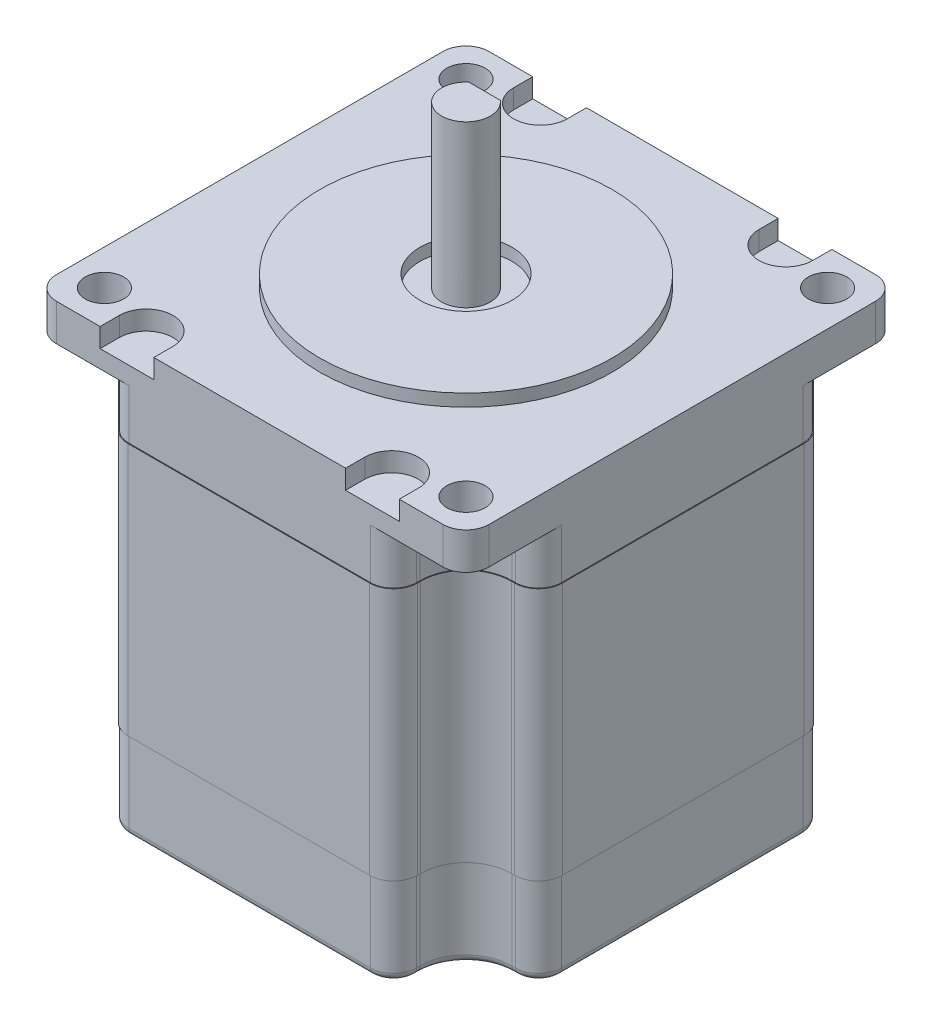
from build123d import *

# Parameters (mm, degrees)
SKETCH1_W               = 56.4
SKETCH1_H               = 56.4
BOSS_EXTRUDE1_DEPTH     = 27.9
CUT_EXTRUDE1_START      = 4.8
CUT_EXTRUDE1_DEPTH      = 64.78658761
FILLET1_R               = 3
FILLET2_R               = 1
SKETCH3_R               = 2.5
CUT_EXTRUDE2_DEPTH      = 55.8
SKETCH4_R               = 19.05
BOSS_EXTRUDE2_DEPTH     = 1.6
SKETCH5_R               = 3.175
BOSS_EXTRUDE3_DEPTH     = 21
CUT_EXTRUDE3_START      = -15
CUT_EXTRUDE3_DEPTH      = 15
CUT_EXTRUDE4_DEPTH      = 64.100633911
CUT_EXTRUDE4_DEPTH_BACK = 64.100633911
FILLET3_R               = 5
CUT_EXTRUDE5_START      = -1.6
SKETCH8_R               = 6
SKETCH8_R_2             = 3.175
CUT_EXTRUDE5_DEPTH      = 1.6
CUT_EXTRUDE6_DEPTH      = 2.5
BOSS_EXTRUDE4_START     = -11.5
BOSS_EXTRUDE4_DEPTH     = 33


with BuildPart() as part:
    # Sketch1 → Boss-Extrude1 (new, symmetric)
    with BuildSketch(Plane(origin=(0, 0, 0), x_dir=(1, 0, 0), z_dir=(0, 1, 0))):
        Rectangle(SKETCH1_W, SKETCH1_H)
    extrude(amount=BOSS_EXTRUDE1_DEPTH, both=True)

    # Sketch2 → Cut-Extrude1 (cut, through all)
    with BuildSketch(Plane.XZ.offset(-27.9).offset(CUT_EXTRUDE1_START)):
        with BuildLine():
            Line((-18.75, 28.2), (-18.75, 24.75))
            ThreePointArc((-18.75, 24.75), (-20.507359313, 20.507359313), (-24.75, 18.75))
            Line((-24.75, 18.75), (-28.2, 18.75))
            Line((-28.2, 18.75), (-28.2, 28.2))
            Line((-28.2, 28.2), (-18.75, 28.2))
        make_face()
        with BuildLine():
            Line((28.2, 28.2), (28.2, 18.75))
            Line((28.2, 18.75), (24.75, 18.75))
            ThreePointArc((24.75, 18.75), (20.507359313, 20.507359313), (18.75, 24.75))
            Line((18.75, 24.75), (18.75, 28.2))
            Line((18.75, 28.2), (28.2, 28.2))
        make_face()
        with BuildLine():
            Line((18.75, -28.2), (18.75, -24.75))
            ThreePointArc((18.75, -24.75), (20.507359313, -20.507359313), (24.75, -18.75))
            Line((24.75, -18.75), (28.2, -18.75))
            Line((28.2, -18.75), (28.2, -28.2))
            Line((28.2, -28.2), (18.75, -28.2))
        make_face()
        with BuildLine():
            Line((-28.2, -28.2), (-28.2, -18.75))
            Line((-28.2, -18.75), (-24.75, -18.75))
            ThreePointArc((-24.75, -18.75), (-20.507359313, -20.507359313), (-18.75, -24.75))
            Line((-18.75, -24.75), (-18.75, -28.2))
            Line((-18.75, -28.2), (-28.2, -28.2))
        make_face()
    extrude(amount=CUT_EXTRUDE1_DEPTH, mode=Mode.SUBTRACT)

    # Fillet1
    fillet1_edges = [part.edges().sort_by_distance(p)[0] for p in [
        (-28.2, -2.4, -18.75),
        (-18.75, -2.4, -28.2),
        (18.75, -2.4, -28.2),
        (28.2, -2.4, -18.75),
        (28.2, -2.4, 18.75),
        (18.75, -2.4, 28.2),
        (-18.75, -2.4, 28.2),
        (-28.2, -2.4, 18.75),
        (28.2, 25.5, 28.2),
        (-28.2, 25.5, 28.2),
        (-28.2, 25.5, -28.2),
        (28.2, 25.5, -28.2),
    ]]
    fillet(fillet1_edges, radius=FILLET1_R)

    # Fillet2
    fillet2_edges = [part.edges().sort_by_distance(p)[0] for p in [
        (-20.507359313, -27.9, -20.507359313),
        (-24.975, -27.9, -18.75),
        (20.507359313, -27.9, -20.507359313),
        (18.75, -27.9, -24.975),
        (20.507359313, -27.9, 20.507359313),
        (24.975, -27.9, 18.75),
        (-20.507359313, -27.9, 20.507359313),
        (-18.75, -27.9, 24.975),
        (-28.2, -27.9, 0),
        (-18.75, -27.9, -24.975),
        (0, -27.9, -28.2),
        (24.975, -27.9, -18.75),
        (28.2, -27.9, 0),
        (18.75, -27.9, 24.975),
        (0, -27.9, 28.2),
        (-24.975, -27.9, 18.75),
        (-17.871320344, -27.9, 27.321320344),
        (-17.871320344, -27.9, -27.321320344),
        (17.871320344, -27.9, -27.321320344),
        (27.321320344, -27.9, -17.871320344),
        (27.321320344, -27.9, 17.871320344),
        (17.871320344, -27.9, 27.321320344),
        (-27.321320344, -27.9, 17.871320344),
        (-27.321320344, -27.9, -17.871320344),
    ]]
    fillet(fillet2_edges, radius=FILLET2_R)

    # Sketch3 → Cut-Extrude2 (cut)
    with BuildSketch(Plane(origin=(0, 27.9, 0), x_dir=(1, 0, 0), z_dir=(0, 1, 0))):
        with Locations(Location((23.57, 23.57, 0), (0, 0, 270))):
            Circle(SKETCH3_R)
        with Locations(Location((-23.57, 23.57, 0), (0, 0, 90))):
            Circle(SKETCH3_R)
        with Locations(Location((23.57, -23.57, 0), (0, 0, 90))):
            Circle(SKETCH3_R)
        with Locations(Location((-23.57, -23.57, 0), (0, 0, 270))):
            Circle(SKETCH3_R)
    extrude(amount=-CUT_EXTRUDE2_DEPTH, mode=Mode.SUBTRACT)

    # Sketch4 → Boss-Extrude2 (add)
    with BuildSketch(Plane(origin=(0, 27.9, 0), x_dir=(1, 0, 0), z_dir=(0, 1, 0))):
        with Locations(Location((0, 0, 0), (0, 0, 270))):
            Circle(SKETCH4_R)
    extrude(amount=BOSS_EXTRUDE2_DEPTH)

    # Sketch5 → Boss-Extrude3 (add)
    with BuildSketch(Plane(origin=(0, 27.9, 0), x_dir=(1, 0, 0), z_dir=(0, 1, 0))):
        with Locations(Location((0, 0, 0), (0, 0, 90))):
            Circle(SKETCH5_R)
    extrude(amount=BOSS_EXTRUDE3_DEPTH)

    # Sketch6 → Cut-Extrude3 (cut)
    with BuildSketch(Plane(origin=(0, 48.9, 0), x_dir=(1, 0, 0), z_dir=(0, 1, 0)).offset(CUT_EXTRUDE3_START)):
        with BuildLine():
            Line((-2.049390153, 2.425), (2.049390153, 2.425))
            ThreePointArc((2.049390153, 2.425), (0, 3.175), (-2.049390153, 2.425))
        make_face()
    extrude(amount=CUT_EXTRUDE3_DEPTH, mode=Mode.SUBTRACT)

    # Sketch7 → Cut-Extrude4 (cut, two sides: drawn at the far end of the back side and taken through both)
    with BuildSketch(Plane(origin=(0, 0, 0), x_dir=(0, 0, -1), z_dir=(1, 0, 0)).offset(-CUT_EXTRUDE4_DEPTH_BACK)):
        Polygon((2.425, 33.9), (3.175, 31.9), (3.175, 33.9), align=None)
    extrude(amount=CUT_EXTRUDE4_DEPTH + CUT_EXTRUDE4_DEPTH_BACK, mode=Mode.SUBTRACT)

    # Fillet3
    fillet3_edges = [part.edges().sort_by_distance(p)[0] for p in [
        (0, 33.9, -2.425),
    ]]
    fillet(fillet3_edges, radius=FILLET3_R)

    # Sketch8 → Cut-Extrude5 (cut)
    with BuildSketch(Plane(origin=(0, 29.5, 0), x_dir=(1, 0, 0), z_dir=(0, 1, 0)).offset(CUT_EXTRUDE5_START)):
        with Locations(Location((0, 0, 0), (0, 0, 270))):
            Circle(SKETCH8_R)
        with Locations(Location((0, 0, 0), (0, 0, 59.774237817))):
            Circle(SKETCH8_R_2, mode=Mode.SUBTRACT)
    extrude(amount=CUT_EXTRUDE5_DEPTH, mode=Mode.SUBTRACT)

    # Sketch9 → Cut-Extrude6 (cut)
    with BuildSketch(Plane(origin=(0, 27.9, 0), x_dir=(1, 0, 0), z_dir=(0, 1, 0))):
        with BuildLine():
            Line((-19.5, 28.2), (-12.5, 28.2))
            Line((-12.5, 28.2), (-12.5, 25.7))
            ThreePointArc((-12.5, 25.7), (-16, 22.2), (-19.5, 25.7))
            Line((-19.5, 25.7), (-19.5, 28.2))
        make_face()
        with BuildLine():
            Line((12.5, 28.2), (12.5, 25.7))
            ThreePointArc((12.5, 25.7), (16, 22.2), (19.5, 25.7))
            Line((19.5, 25.7), (19.5, 28.2))
            Line((19.5, 28.2), (12.5, 28.2))
        make_face()
        with BuildLine():
            Line((19.5, -28.2), (12.5, -28.2))
            Line((12.5, -28.2), (12.5, -25.7))
            ThreePointArc((12.5, -25.7), (16, -22.2), (19.5, -25.7))
            Line((19.5, -25.7), (19.5, -28.2))
        make_face()
        with BuildLine():
            Line((-12.5, -28.2), (-12.5, -25.7))
            ThreePointArc((-12.5, -25.7), (-16, -22.2), (-19.5, -25.7))
            Line((-19.5, -25.7), (-19.5, -28.2))
            Line((-19.5, -28.2), (-12.5, -28.2))
        make_face()
    extrude(amount=-CUT_EXTRUDE6_DEPTH, mode=Mode.SUBTRACT)


with BuildPart() as body_2:
    # Sketch10 → Boss-Extrude4 (new body)
    with BuildSketch(Plane.XZ.offset(27.9).offset(BOSS_EXTRUDE4_START)):
        with BuildLine():
            Line((25.2, 18.85), (24.75, 18.85))
            ThreePointArc((24.75, 18.85), (20.578069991, 20.578069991), (18.85, 24.75))
            Line((18.85, 24.75), (18.85, 25.2))
            ThreePointArc((18.85, 25.2), (17.942031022, 27.392031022), (15.75, 28.3))
            Line((15.75, 28.3), (-15.75, 28.3))
            ThreePointArc((-15.75, 28.3), (-17.942031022, 27.392031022), (-18.85, 25.2))
            Line((-18.85, 25.2), (-18.85, 24.75))
            ThreePointArc((-18.85, 24.75), (-20.578069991, 20.578069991), (-24.75, 18.85))
            Line((-24.75, 18.85), (-25.2, 18.85))
            ThreePointArc((-25.2, 18.85), (-27.392031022, 17.942031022), (-28.3, 15.75))
            Line((-28.3, 15.75), (-28.3, -15.75))
            ThreePointArc((-28.3, -15.75), (-27.392031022, -17.942031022), (-25.2, -18.85))
            Line((-25.2, -18.85), (-24.75, -18.85))
            ThreePointArc((-24.75, -18.85), (-20.578069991, -20.578069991), (-18.85, -24.75))
            Line((-18.85, -24.75), (-18.85, -25.2))
            ThreePointArc((-18.85, -25.2), (-17.942031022, -27.392031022), (-15.75, -28.3))
            Line((-15.75, -28.3), (15.75, -28.3))
            ThreePointArc((15.75, -28.3), (17.942031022, -27.392031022), (18.85, -25.2))
            Line((18.85, -25.2), (18.85, -24.75))
            ThreePointArc((18.85, -24.75), (20.578069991, -20.578069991), (24.75, -18.85))
            Line((24.75, -18.85), (25.2, -18.85))
            ThreePointArc((25.2, -18.85), (27.392031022, -17.942031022), (28.3, -15.75))
            Line((28.3, -15.75), (28.3, 15.75))
            ThreePointArc((28.3, 15.75), (27.392031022, 17.942031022), (25.2, 18.85))
        make_face()
        with BuildLine():
            Line((28.2, -15.75), (28.2, 15.75))
            ThreePointArc((28.2, 15.75), (27.321320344, 17.871320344), (25.2, 18.75))
            Line((25.2, 18.75), (24.75, 18.75))
            ThreePointArc((24.75, 18.75), (20.507359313, 20.507359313), (18.75, 24.75))
            Line((18.75, 24.75), (18.75, 25.2))
            ThreePointArc((18.75, 25.2), (17.871320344, 27.321320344), (15.75, 28.2))
            Line((15.75, 28.2), (-15.75, 28.2))
            ThreePointArc((-15.75, 28.2), (-17.871320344, 27.321320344), (-18.75, 25.2))
            Line((-18.75, 25.2), (-18.75, 24.75))
            ThreePointArc((-18.75, 24.75), (-20.507359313, 20.507359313), (-24.75, 18.75))
            Line((-24.75, 18.75), (-25.2, 18.75))
            ThreePointArc((-25.2, 18.75), (-27.321320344, 17.871320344), (-28.2, 15.75))
            Line((-28.2, 15.75), (-28.2, -15.75))
            ThreePointArc((-28.2, -15.75), (-27.321320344, -17.871320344), (-25.2, -18.75))
            Line((-25.2, -18.75), (-24.75, -18.75))
            ThreePointArc((-24.75, -18.75), (-20.507359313, -20.507359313), (-18.75, -24.75))
            Line((-18.75, -24.75), (-18.75, -25.2))
            ThreePointArc((-18.75, -25.2), (-17.871320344, -27.321320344), (-15.75, -28.2))
            Line((-15.75, -28.2), (15.75, -28.2))
            ThreePointArc((15.75, -28.2), (17.871320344, -27.321320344), (18.75, -25.2))
            Line((18.75, -25.2), (18.75, -24.75))
            ThreePointArc((18.75, -24.75), (20.507359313, -20.507359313), (24.75, -18.75))
            Line((24.75, -18.75), (25.2, -18.75))
            ThreePointArc((25.2, -18.75), (27.321320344, -17.871320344), (28.2, -15.75))
        make_face(mode=Mode.SUBTRACT)
    extrude(amount=-BOSS_EXTRUDE4_DEPTH)


solid = Compound([part.part, body_2.part])
